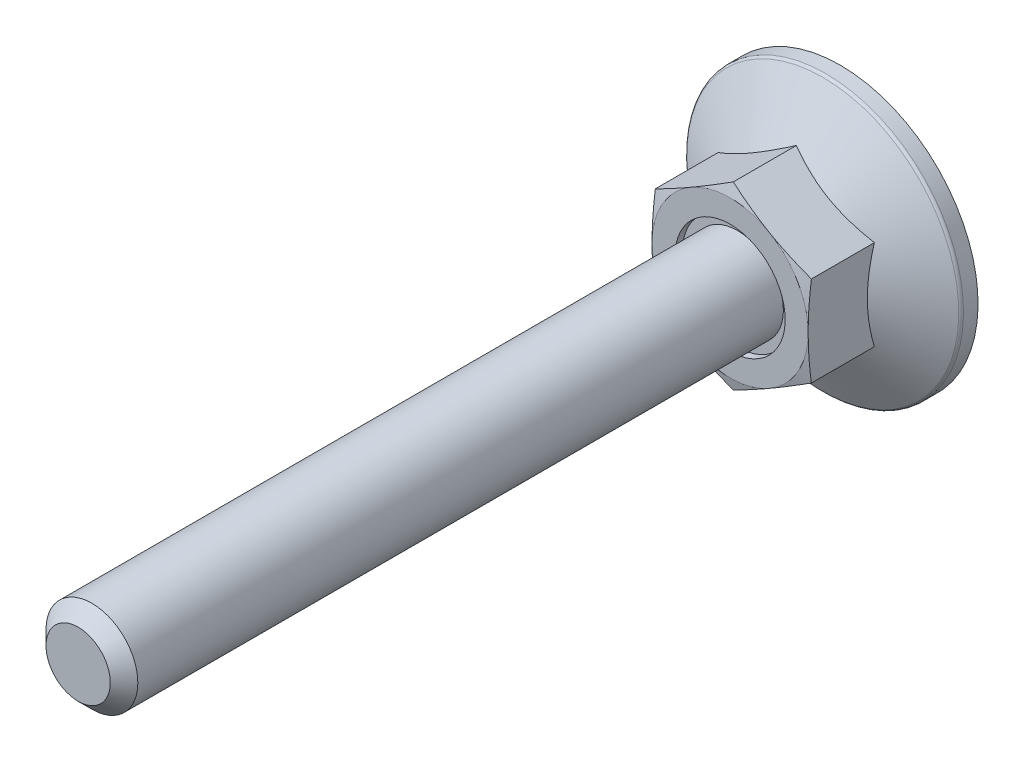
ISO-10303-21;
HEADER;
FILE_DESCRIPTION(('STEP AP214'),'2;1');
FILE_NAME('part.step','',(''),(''),'','','');
FILE_SCHEMA(('AUTOMOTIVE_DESIGN { 1 0 10303 214 1 1 1 1 }'));
ENDSEC;
DATA;
#1=APPLICATION_CONTEXT('core data for automotive mechanical design processes');
#2=APPLICATION_PROTOCOL_DEFINITION('international standard','automotive_design',2000,#1);
#3=PRODUCT_CONTEXT('',#1,'mechanical');
#4=PRODUCT('Part','Part','',(#3));
#5=PRODUCT_RELATED_PRODUCT_CATEGORY('part','',(#4));
#6=PRODUCT_DEFINITION_FORMATION('','',#4);
#7=PRODUCT_DEFINITION_CONTEXT('part definition',#1,'design');
#8=PRODUCT_DEFINITION('design','',#6,#7);
#9=PRODUCT_DEFINITION_SHAPE('','',#8);
#10=(LENGTH_UNIT() NAMED_UNIT(*) SI_UNIT(.MILLI.,.METRE.));
#11=(NAMED_UNIT(*) PLANE_ANGLE_UNIT() SI_UNIT($,.RADIAN.));
#12=(NAMED_UNIT(*) SI_UNIT($,.STERADIAN.) SOLID_ANGLE_UNIT());
#13=UNCERTAINTY_MEASURE_WITH_UNIT(LENGTH_MEASURE(1.E-05),#10,'distance_accuracy_value','');
#14=(GEOMETRIC_REPRESENTATION_CONTEXT(3) GLOBAL_UNCERTAINTY_ASSIGNED_CONTEXT((#13)) GLOBAL_UNIT_ASSIGNED_CONTEXT((#10,
#11,#12)) REPRESENTATION_CONTEXT('',''));
#15=CARTESIAN_POINT('',(0.,0.,0.));
#16=DIRECTION('',(0.,0.,1.));
#17=DIRECTION('',(1.,0.,0.));
#18=AXIS2_PLACEMENT_3D('',#15,#16,#17);
#19=CARTESIAN_POINT('',(0.,0.,11.2));
#20=DIRECTION('',(0.,0.,-1.));
#21=DIRECTION('',(0.,1.,0.));
#22=AXIS2_PLACEMENT_3D('',#19,#20,#21);
#23=PLANE('',#22);
#24=CARTESIAN_POINT('',(0.,0.,11.2));
#25=DIRECTION('',(0.,0.,-1.));
#26=DIRECTION('',(0.,1.,0.));
#27=AXIS2_PLACEMENT_3D('',#24,#25,#26);
#28=CIRCLE('',#27,6.);
#29=CARTESIAN_POINT('',(0.,6.,11.2));
#30=VERTEX_POINT('',#29);
#31=EDGE_CURVE('E108',#30,#30,#28,.T.);
#32=ORIENTED_EDGE('',*,*,#31,.F.);
#33=EDGE_LOOP('',(#32));
#34=FACE_BOUND('',#33,.T.);
#35=CARTESIAN_POINT('',(0.,0.,11.2));
#36=DIRECTION('',(0.,0.,-1.));
#37=DIRECTION('',(0.,1.,0.));
#38=AXIS2_PLACEMENT_3D('',#35,#36,#37);
#39=CIRCLE('',#38,5.);
#40=CARTESIAN_POINT('',(0.,5.,11.2));
#41=VERTEX_POINT('',#40);
#42=EDGE_CURVE('E259',#41,#41,#39,.F.);
#43=ORIENTED_EDGE('',*,*,#42,.F.);
#44=EDGE_LOOP('',(#43));
#45=FACE_BOUND('',#44,.T.);
#46=ADVANCED_FACE('F14',(#34,#45),#23,.F.);
#47=CARTESIAN_POINT('',(0.,9.81495457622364,32.));
#48=DIRECTION('',(0.5,-0.866025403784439,0.));
#49=DIRECTION('',(0.866025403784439,0.5,0.));
#50=AXIS2_PLACEMENT_3D('',#47,#48,#49);
#51=PLANE('',#50);
#52=CARTESIAN_POINT('',(-8.5002,4.90736181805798,4.7935207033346));
#53=CARTESIAN_POINT('',(-8.31336077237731,5.01523349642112,4.85579061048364));
#54=CARTESIAN_POINT('',(-8.1258249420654,5.1235073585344,4.91523445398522));
#55=CARTESIAN_POINT('',(-7.74923024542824,5.34093440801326,5.02769163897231));
#56=CARTESIAN_POINT('',(-7.56017075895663,5.45008795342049,5.08070220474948));
#57=CARTESIAN_POINT('',(-6.9899652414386,5.77929626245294,5.22904336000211));
#58=CARTESIAN_POINT('',(-6.60656835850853,6.00065055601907,5.31341782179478));
#59=CARTESIAN_POINT('',(-6.03282233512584,6.33190297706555,5.41235673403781));
#60=CARTESIAN_POINT('',(-5.84418723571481,6.44081150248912,5.44054155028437));
#61=CARTESIAN_POINT('',(-5.46606397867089,6.65912106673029,5.48780266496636));
#62=CARTESIAN_POINT('',(-5.27657589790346,6.76852206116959,5.5068797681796));
#63=CARTESIAN_POINT('',(-4.8972734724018,6.98751241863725,5.53544197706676));
#64=CARTESIAN_POINT('',(-4.70745974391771,7.09710142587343,5.54493796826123));
#65=CARTESIAN_POINT('',(-4.32765694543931,7.3163806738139,5.55413437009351));
#66=CARTESIAN_POINT('',(-4.13766788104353,7.42607091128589,5.55383508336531));
#67=CARTESIAN_POINT('',(-3.78247698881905,7.63114046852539,5.54412227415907));
#68=CARTESIAN_POINT('',(-3.6172500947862,7.72653426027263,5.53589358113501));
#69=CARTESIAN_POINT('',(-3.28718328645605,7.9170984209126,5.51218750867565));
#70=CARTESIAN_POINT('',(-3.12234339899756,8.01226877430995,5.49670964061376));
#71=CARTESIAN_POINT('',(-2.62846189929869,8.29741139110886,5.43976812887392));
#72=CARTESIAN_POINT('',(-2.30029449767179,8.48687892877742,5.38780368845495));
#73=CARTESIAN_POINT('',(-1.64047857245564,8.86782383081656,5.25789180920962));
#74=CARTESIAN_POINT('',(-1.30891425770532,9.05925257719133,5.17939367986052));
#75=CARTESIAN_POINT('',(-0.650730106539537,9.43925537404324,5.00123540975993));
#76=CARTESIAN_POINT('',(-0.32410184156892,9.62783429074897,4.90161711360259));
#77=CARTESIAN_POINT('',(0.000200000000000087,9.81507004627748,4.7935207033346));
#78=B_SPLINE_CURVE_WITH_KNOTS('',3,(#52,#53,#54,#55,#56,#57,#58,#59,#60,#61,#62,#63,#64,#65,#66,
#67,#68,#69,#70,#71,#72,#73,#74,#75,#76,#77),.UNSPECIFIED.,.F.,.F.,(4,2,2,2,2,2,2,2,2,2,2,2,4),
(0.,0.673596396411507,1.34748239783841,2.69805431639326,3.356799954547,4.01548737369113,
4.67342558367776,5.33134346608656,5.90409556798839,6.47688628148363,7.62328361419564,
8.79510569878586,9.9646274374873),.UNSPECIFIED.);
#79=CARTESIAN_POINT('',(-8.5,4.90747728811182,4.79358737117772));
#80=VERTEX_POINT('',#79);
#81=CARTESIAN_POINT('',(0.,9.81495457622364,4.79358737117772));
#82=VERTEX_POINT('',#81);
#83=EDGE_CURVE('E97',#80,#82,#78,.T.);
#84=ORIENTED_EDGE('',*,*,#83,.F.);
#85=DIRECTION('',(0.,0.,-1.));
#86=VECTOR('',#85,1.);
#87=CARTESIAN_POINT('',(-8.5,4.90747728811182,32.));
#88=LINE('',#87,#86);
#89=CARTESIAN_POINT('',(-8.5,4.90747728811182,11.6476589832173));
#90=VERTEX_POINT('',#89);
#91=EDGE_CURVE('E86',#90,#80,#88,.T.);
#92=ORIENTED_EDGE('',*,*,#91,.F.);
#93=CARTESIAN_POINT('',(0.000200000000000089,9.81507004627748,11.6476280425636));
#94=CARTESIAN_POINT('',(-0.352800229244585,9.61126526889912,11.7022599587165));
#95=CARTESIAN_POINT('',(-0.706440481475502,9.40709097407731,11.7518566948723));
#96=CARTESIAN_POINT('',(-1.41496987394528,8.99802133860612,11.8389934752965));
#97=CARTESIAN_POINT('',(-1.76985946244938,8.79312573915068,11.8765286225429));
#98=CARTESIAN_POINT('',(-2.47873586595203,8.38385575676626,11.9373509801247));
#99=CARTESIAN_POINT('',(-2.83271788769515,8.17948414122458,11.9607107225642));
#100=CARTESIAN_POINT('',(-3.5411333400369,7.77048028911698,11.9920337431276));
#101=CARTESIAN_POINT('',(-3.89556667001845,7.56584811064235,12.));
#102=CARTESIAN_POINT('',(-4.60443332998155,7.15658375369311,12.));
#103=CARTESIAN_POINT('',(-4.9588666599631,6.95195157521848,11.9920337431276));
#104=CARTESIAN_POINT('',(-5.66728211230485,6.54294772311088,11.9607107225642));
#105=CARTESIAN_POINT('',(-6.02126413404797,6.33857610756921,11.9373509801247));
#106=CARTESIAN_POINT('',(-6.73014053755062,5.92930612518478,11.8765286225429));
#107=CARTESIAN_POINT('',(-7.08503012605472,5.72441052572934,11.8389934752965));
#108=CARTESIAN_POINT('',(-7.7935595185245,5.31534089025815,11.7518566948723));
#109=CARTESIAN_POINT('',(-8.14719977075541,5.11116659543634,11.7022599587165));
#110=CARTESIAN_POINT('',(-8.5002,4.90736181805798,11.6476280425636));
#111=B_SPLINE_CURVE_WITH_KNOTS('',3,(#93,#94,#95,#96,#97,#98,#99,#100,#101,#102,#103,#104,#105,
#106,#107,#108,#109,#110),.UNSPECIFIED.,.F.,.F.,(4,2,2,2,2,2,2,2,4),(0.,1.23382789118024,
2.46815608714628,3.69611406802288,4.92383440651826,6.15155474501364,7.37951272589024,
8.61384092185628,9.84766881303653),.UNSPECIFIED.);
#112=CARTESIAN_POINT('',(-4.25,7.36121593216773,12.));
#113=VERTEX_POINT('',#112);
#114=EDGE_CURVE('E186',#113,#90,#111,.T.);
#115=ORIENTED_EDGE('',*,*,#114,.F.);
#116=CARTESIAN_POINT('',(0.,9.81495457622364,11.6476589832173));
#117=VERTEX_POINT('',#116);
#118=EDGE_CURVE('E318',#117,#113,#111,.T.);
#119=ORIENTED_EDGE('',*,*,#118,.F.);
#120=DIRECTION('',(0.,0.,-1.));
#121=VECTOR('',#120,1.);
#122=CARTESIAN_POINT('',(0.,9.81495457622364,32.));
#123=LINE('',#122,#121);
#124=EDGE_CURVE('E101',#117,#82,#123,.T.);
#125=ORIENTED_EDGE('',*,*,#124,.T.);
#126=EDGE_LOOP('',(#84,#92,#115,#119,#125));
#127=FACE_BOUND('',#126,.T.);
#128=ADVANCED_FACE('F100',(#127),#51,.F.);
#129=CARTESIAN_POINT('',(8.5,4.90747728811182,32.));
#130=DIRECTION('',(-0.5,-0.866025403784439,0.));
#131=DIRECTION('',(0.866025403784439,-0.5,0.));
#132=AXIS2_PLACEMENT_3D('',#129,#130,#131);
#133=PLANE('',#132);
#134=CARTESIAN_POINT('',(-0.0002,9.81507004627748,4.7935207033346));
#135=CARTESIAN_POINT('',(0.186639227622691,9.70719836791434,4.85579061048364));
#136=CARTESIAN_POINT('',(0.374175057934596,9.59892450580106,4.91523445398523));
#137=CARTESIAN_POINT('',(0.750769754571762,9.3814974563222,5.02769163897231));
#138=CARTESIAN_POINT('',(0.939829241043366,9.27234391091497,5.08070220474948));
#139=CARTESIAN_POINT('',(1.5100347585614,8.94313560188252,5.22904336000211));
#140=CARTESIAN_POINT('',(1.89343164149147,8.72178130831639,5.31341782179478));
#141=CARTESIAN_POINT('',(2.46717766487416,8.39052888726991,5.41235673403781));
#142=CARTESIAN_POINT('',(2.65581276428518,8.28162036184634,5.44054155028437));
#143=CARTESIAN_POINT('',(3.03393602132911,8.06331079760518,5.48780266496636));
#144=CARTESIAN_POINT('',(3.22342410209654,7.95390980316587,5.5068797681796));
#145=CARTESIAN_POINT('',(3.6027265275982,7.73491944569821,5.53544197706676));
#146=CARTESIAN_POINT('',(3.79254025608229,7.62533043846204,5.54493796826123));
#147=CARTESIAN_POINT('',(4.17234305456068,7.40605119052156,5.55413437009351));
#148=CARTESIAN_POINT('',(4.36233211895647,7.29636095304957,5.55383508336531));
#149=CARTESIAN_POINT('',(4.71752301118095,7.09129139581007,5.54412227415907));
#150=CARTESIAN_POINT('',(4.8827499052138,6.99589760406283,5.53589358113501));
#151=CARTESIAN_POINT('',(5.21281671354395,6.80533344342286,5.51218750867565));
#152=CARTESIAN_POINT('',(5.37765660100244,6.71016309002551,5.49670964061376));
#153=CARTESIAN_POINT('',(5.87153810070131,6.42502047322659,5.43976812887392));
#154=CARTESIAN_POINT('',(6.19970550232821,6.23555293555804,5.38780368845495));
#155=CARTESIAN_POINT('',(6.85952142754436,5.8546080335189,5.25789180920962));
#156=CARTESIAN_POINT('',(7.19108574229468,5.66317928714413,5.17939367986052));
#157=CARTESIAN_POINT('',(7.84926989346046,5.28317649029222,5.00123540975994));
#158=CARTESIAN_POINT('',(8.17589815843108,5.09459757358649,4.90161711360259));
#159=CARTESIAN_POINT('',(8.5002,4.90736181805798,4.7935207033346));
#160=B_SPLINE_CURVE_WITH_KNOTS('',3,(#134,#135,#136,#137,#138,#139,#140,#141,#142,#143,#144,
#145,#146,#147,#148,#149,#150,#151,#152,#153,#154,#155,#156,#157,#158,#159),.UNSPECIFIED.,.F.,
.F.,(4,2,2,2,2,2,2,2,2,2,2,2,4),(0.,0.673596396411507,1.34748239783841,2.69805431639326,
3.356799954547,4.01548737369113,4.67342558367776,5.33134346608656,5.90409556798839,
6.47688628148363,7.62328361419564,8.79510569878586,9.9646274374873),.UNSPECIFIED.);
#161=CARTESIAN_POINT('',(8.5,4.90747728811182,4.79358737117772));
#162=VERTEX_POINT('',#161);
#163=EDGE_CURVE('E29',#82,#162,#160,.T.);
#164=ORIENTED_EDGE('',*,*,#163,.F.);
#165=ORIENTED_EDGE('',*,*,#124,.F.);
#166=CARTESIAN_POINT('',(8.5002,4.90736181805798,11.6476280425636));
#167=CARTESIAN_POINT('',(8.14719977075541,5.11116659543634,11.7022599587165));
#168=CARTESIAN_POINT('',(7.7935595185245,5.31534089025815,11.7518566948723));
#169=CARTESIAN_POINT('',(7.08503012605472,5.72441052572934,11.8389934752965));
#170=CARTESIAN_POINT('',(6.73014053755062,5.92930612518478,11.8765286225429));
#171=CARTESIAN_POINT('',(6.02126413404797,6.33857610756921,11.9373509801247));
#172=CARTESIAN_POINT('',(5.66728211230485,6.54294772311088,11.9607107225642));
#173=CARTESIAN_POINT('',(4.9588666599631,6.95195157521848,11.9920337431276));
#174=CARTESIAN_POINT('',(4.60443332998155,7.15658375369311,12.));
#175=CARTESIAN_POINT('',(3.89556667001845,7.56584811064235,12.));
#176=CARTESIAN_POINT('',(3.5411333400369,7.77048028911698,11.9920337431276));
#177=CARTESIAN_POINT('',(2.83271788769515,8.17948414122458,11.9607107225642));
#178=CARTESIAN_POINT('',(2.47873586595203,8.38385575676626,11.9373509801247));
#179=CARTESIAN_POINT('',(1.76985946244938,8.79312573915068,11.8765286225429));
#180=CARTESIAN_POINT('',(1.41496987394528,8.99802133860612,11.8389934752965));
#181=CARTESIAN_POINT('',(0.706440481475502,9.40709097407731,11.7518566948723));
#182=CARTESIAN_POINT('',(0.352800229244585,9.61126526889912,11.7022599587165));
#183=CARTESIAN_POINT('',(-0.000200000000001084,9.81507004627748,11.6476280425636));
#184=B_SPLINE_CURVE_WITH_KNOTS('',3,(#166,#167,#168,#169,#170,#171,#172,#173,#174,#175,#176,
#177,#178,#179,#180,#181,#182,#183),.UNSPECIFIED.,.F.,.F.,(4,2,2,2,2,2,2,2,4),(0.,
1.23382789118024,2.46815608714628,3.69611406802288,4.92383440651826,6.15155474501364,
7.37951272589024,8.61384092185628,9.84766881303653),.UNSPECIFIED.);
#185=CARTESIAN_POINT('',(4.25,7.36121593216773,12.));
#186=VERTEX_POINT('',#185);
#187=EDGE_CURVE('E177',#186,#117,#184,.T.);
#188=ORIENTED_EDGE('',*,*,#187,.F.);
#189=CARTESIAN_POINT('',(8.5,4.90747728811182,11.6476589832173));
#190=VERTEX_POINT('',#189);
#191=EDGE_CURVE('E184',#190,#186,#184,.T.);
#192=ORIENTED_EDGE('',*,*,#191,.F.);
#193=DIRECTION('',(0.,0.,-1.));
#194=VECTOR('',#193,1.);
#195=CARTESIAN_POINT('',(8.5,4.90747728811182,32.));
#196=LINE('',#195,#194);
#197=EDGE_CURVE('E216',#190,#162,#196,.T.);
#198=ORIENTED_EDGE('',*,*,#197,.T.);
#199=EDGE_LOOP('',(#164,#165,#188,#192,#198));
#200=FACE_BOUND('',#199,.T.);
#201=ADVANCED_FACE('F192',(#200),#133,.F.);
#202=CARTESIAN_POINT('',(8.5,-4.90747728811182,32.));
#203=DIRECTION('',(-1.,0.,0.));
#204=DIRECTION('',(0.,-1.,0.));
#205=AXIS2_PLACEMENT_3D('',#202,#203,#204);
#206=PLANE('',#205);
#207=CARTESIAN_POINT('',(8.5,13.0314294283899,1.47752704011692));
#208=CARTESIAN_POINT('',(8.5,12.6612665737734,1.65647774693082));
#209=CARTESIAN_POINT('',(8.5,12.290237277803,1.83366776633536));
#210=CARTESIAN_POINT('',(8.5,11.5459841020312,2.1835324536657));
#211=CARTESIAN_POINT('',(8.5,11.1727598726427,2.3562063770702));
#212=CARTESIAN_POINT('',(8.5,10.4216603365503,2.69694543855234));
#213=CARTESIAN_POINT('',(8.5,10.0437706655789,2.86497902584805));
#214=CARTESIAN_POINT('',(8.5,9.2849306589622,3.19396010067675));
#215=CARTESIAN_POINT('',(8.5,8.90398047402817,3.35490793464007));
#216=CARTESIAN_POINT('',(8.5,8.12702308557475,3.67249615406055));
#217=CARTESIAN_POINT('',(8.5,7.73090483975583,3.82886642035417));
#218=CARTESIAN_POINT('',(8.5,6.93398073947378,4.12940330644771));
#219=CARTESIAN_POINT('',(8.5,6.53317435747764,4.27356853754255));
#220=CARTESIAN_POINT('',(8.5,5.72703031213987,4.54580160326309));
#221=CARTESIAN_POINT('',(8.5,5.32170421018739,4.67390329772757));
#222=CARTESIAN_POINT('',(8.5,4.50525785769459,4.90980359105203));
#223=CARTESIAN_POINT('',(8.5,4.09413952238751,5.01760873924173));
#224=CARTESIAN_POINT('',(8.5,3.26789885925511,5.20711197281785));
#225=CARTESIAN_POINT('',(8.5,2.85280627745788,5.28893618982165));
#226=CARTESIAN_POINT('',(8.5,2.22651264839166,5.38853539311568));
#227=CARTESIAN_POINT('',(8.5,2.01712321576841,5.41788026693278));
#228=CARTESIAN_POINT('',(8.5,1.59735566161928,5.46827917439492));
#229=CARTESIAN_POINT('',(8.5,1.38697763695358,5.48933400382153));
#230=CARTESIAN_POINT('',(8.5,0.968196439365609,5.52247691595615));
#231=CARTESIAN_POINT('',(8.5,0.759802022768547,5.53467524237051));
#232=CARTESIAN_POINT('',(8.5,0.342684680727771,5.55026003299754));
#233=CARTESIAN_POINT('',(8.5,0.133961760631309,5.5536466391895));
#234=CARTESIAN_POINT('',(8.5,-0.283445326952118,5.55152742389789));
#235=CARTESIAN_POINT('',(8.5,-0.492129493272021,5.546021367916));
#236=CARTESIAN_POINT('',(8.5,-0.909085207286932,5.52624824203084));
#237=CARTESIAN_POINT('',(8.5,-1.11735673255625,5.51198070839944));
#238=CARTESIAN_POINT('',(8.5,-1.62231800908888,5.46706351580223));
#239=CARTESIAN_POINT('',(8.5,-1.91862399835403,5.43201243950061));
#240=CARTESIAN_POINT('',(8.5,-2.50892471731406,5.34612267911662));
#241=CARTESIAN_POINT('',(8.5,-2.80291910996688,5.29528173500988));
#242=CARTESIAN_POINT('',(8.5,-3.68114216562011,5.12178025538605));
#243=CARTESIAN_POINT('',(8.5,-4.26128126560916,4.97817413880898));
#244=CARTESIAN_POINT('',(8.5,-5.12903133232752,4.73045572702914));
#245=CARTESIAN_POINT('',(8.5,-5.42116721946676,4.64129591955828));
#246=CARTESIAN_POINT('',(8.5,-6.0025970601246,4.45406394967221));
#247=CARTESIAN_POINT('',(8.5,-6.29189099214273,4.35599171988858));
#248=CARTESIAN_POINT('',(8.5,-6.86774141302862,4.15248019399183));
#249=CARTESIAN_POINT('',(8.5,-7.15429879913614,4.0470434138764));
#250=CARTESIAN_POINT('',(8.5,-7.72505625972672,3.83000899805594));
#251=CARTESIAN_POINT('',(8.5,-8.00925638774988,3.71841150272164));
#252=CARTESIAN_POINT('',(8.5,-8.7865968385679,3.40502511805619));
#253=CARTESIAN_POINT('',(8.5,-9.2776226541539,3.197996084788));
#254=CARTESIAN_POINT('',(8.5,-10.2546964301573,2.77246752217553));
#255=CARTESIAN_POINT('',(8.5,-10.7407438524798,2.55396676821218));
#256=CARTESIAN_POINT('',(8.5,-11.7090438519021,2.108282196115));
#257=CARTESIAN_POINT('',(8.5,-12.1912949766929,1.88109523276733));
#258=CARTESIAN_POINT('',(8.5,-13.1526185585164,1.42016244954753));
#259=CARTESIAN_POINT('',(8.5,-13.6316911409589,1.18641689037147));
#260=CARTESIAN_POINT('',(8.5,-14.588034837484,0.713462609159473));
#261=CARTESIAN_POINT('',(8.5,-15.0653020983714,0.47424611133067));
#262=CARTESIAN_POINT('',(8.5,-16.0177905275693,-0.00822936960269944));
#263=CARTESIAN_POINT('',(8.5,-16.4930116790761,-0.251488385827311));
#264=CARTESIAN_POINT('',(8.5,-17.4416812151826,-0.741191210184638));
#265=CARTESIAN_POINT('',(8.5,-17.9151299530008,-0.987634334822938));
#266=CARTESIAN_POINT('',(8.5,-18.8606492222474,-1.48315179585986));
#267=CARTESIAN_POINT('',(8.5,-19.3327197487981,-1.73222614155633));
#268=CARTESIAN_POINT('',(8.5,-20.6461392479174,-2.42904815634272));
#269=CARTESIAN_POINT('',(8.5,-21.4862394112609,-2.87914918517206));
#270=CARTESIAN_POINT('',(8.5,-23.1638169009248,-3.78432075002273));
#271=CARTESIAN_POINT('',(8.5,-24.0012940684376,-4.23939157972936));
#272=CARTESIAN_POINT('',(8.5,-25.671623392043,-5.15180725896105));
#273=CARTESIAN_POINT('',(8.5,-26.5044818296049,-5.60914061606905));
#274=CARTESIAN_POINT('',(8.5,-27.7525740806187,-6.29723391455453));
#275=CARTESIAN_POINT('',(8.5,-28.1683903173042,-6.52693873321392));
#276=CARTESIAN_POINT('',(8.5,-28.9996764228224,-6.98697325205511));
#277=CARTESIAN_POINT('',(8.5,-29.4151462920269,-7.21730295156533));
#278=CARTESIAN_POINT('',(8.5,-29.8304643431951,-7.44790614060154));
#279=B_SPLINE_CURVE_WITH_KNOTS('',3,(#207,#208,#209,#210,#211,#212,#213,#214,#215,#216,#217,
#218,#219,#220,#221,#222,#223,#224,#225,#226,#227,#228,#229,#230,#231,#232,#233,#234,#235,#236,
#237,#238,#239,#240,#241,#242,#243,#244,#245,#246,#247,#248,#249,#250,#251,#252,#253,#254,#255,
#256,#257,#258,#259,#260,#261,#262,#263,#264,#265,#266,#267,#268,#269,#270,#271,#272,#273,#274,
#275,#276,#277,#278),.UNSPECIFIED.,.F.,.F.,(4,2,2,2,2,2,2,2,2,2,2,2,2,2,2,2,2,2,2,2,2,2,2,2,2,2,
2,2,2,2,2,2,2,2,2,4),(0.,1.23346428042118,2.46713064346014,3.70776702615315,4.94834268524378,
6.22578289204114,7.5033682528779,8.77821366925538,10.0526470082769,11.32079515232,
11.9549638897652,12.5890717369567,13.2151443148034,13.8412068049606,14.4672858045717,
15.0933979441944,15.9880059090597,16.8827419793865,18.6732029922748,19.5894472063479,
20.5056983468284,21.4216379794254,22.3375567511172,23.9359919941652,25.5345982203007,
27.1337888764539,28.7329160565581,30.3344778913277,31.9360528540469,33.5372895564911,
35.1385319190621,37.9977422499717,40.8571224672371,43.7075995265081,45.1327331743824,
46.5578652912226),.UNSPECIFIED.);
#280=CARTESIAN_POINT('',(8.5,-4.90747728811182,4.79358737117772));
#281=VERTEX_POINT('',#280);
#282=EDGE_CURVE('E37',#162,#281,#279,.T.);
#283=ORIENTED_EDGE('',*,*,#282,.F.);
#284=ORIENTED_EDGE('',*,*,#197,.F.);
#285=CARTESIAN_POINT('',(8.5,12.9820891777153,10.1197370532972));
#286=CARTESIAN_POINT('',(8.5,12.5964686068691,10.2061594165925));
#287=CARTESIAN_POINT('',(8.5,12.2106068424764,10.2915248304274));
#288=CARTESIAN_POINT('',(8.5,11.4382824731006,10.4595712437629));
#289=CARTESIAN_POINT('',(8.5,11.0518198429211,10.5422521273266));
#290=CARTESIAN_POINT('',(8.5,10.2778290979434,10.7044309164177));
#291=CARTESIAN_POINT('',(8.5,9.89030030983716,10.7839256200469));
#292=CARTESIAN_POINT('',(8.5,9.11443612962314,10.9388739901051));
#293=CARTESIAN_POINT('',(8.5,8.72610074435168,11.0143276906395));
#294=CARTESIAN_POINT('',(8.5,7.95158013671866,11.159650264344));
#295=CARTESIAN_POINT('',(8.5,7.56540239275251,11.2295587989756));
#296=CARTESIAN_POINT('',(8.5,6.79199352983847,11.3632725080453));
#297=CARTESIAN_POINT('',(8.5,6.40476243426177,11.4270778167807));
#298=CARTESIAN_POINT('',(8.5,5.62917169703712,11.54714843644));
#299=CARTESIAN_POINT('',(8.5,5.24081220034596,11.6034146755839));
#300=CARTESIAN_POINT('',(8.5,4.46285737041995,11.70674908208));
#301=CARTESIAN_POINT('',(8.5,4.07326203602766,11.7538172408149));
#302=CARTESIAN_POINT('',(8.5,3.28844017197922,11.8374226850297));
#303=CARTESIAN_POINT('',(8.5,2.89320002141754,11.8738340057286));
#304=CARTESIAN_POINT('',(8.5,2.10172608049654,11.9336139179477));
#305=CARTESIAN_POINT('',(8.5,1.70549231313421,11.9569828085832));
#306=CARTESIAN_POINT('',(8.5,0.91260591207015,11.9893148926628));
#307=CARTESIAN_POINT('',(8.5,0.515953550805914,11.9982846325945));
#308=CARTESIAN_POINT('',(8.5,-0.277408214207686,12.0012669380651));
#309=CARTESIAN_POINT('',(8.5,-0.674117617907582,11.9952795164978));
#310=CARTESIAN_POINT('',(8.5,-1.46847963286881,11.9686842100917));
#311=CARTESIAN_POINT('',(8.5,-1.86613043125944,11.9480232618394));
#312=CARTESIAN_POINT('',(8.5,-2.66049684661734,11.8932602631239));
#313=CARTESIAN_POINT('',(8.5,-3.05721244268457,11.8591579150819));
#314=CARTESIAN_POINT('',(8.5,-3.84970511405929,11.7792347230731));
#315=CARTESIAN_POINT('',(8.5,-4.24548140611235,11.7334062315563));
#316=CARTESIAN_POINT('',(8.5,-5.03576028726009,11.6319377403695));
#317=CARTESIAN_POINT('',(8.5,-5.43026287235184,11.5762977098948));
#318=CARTESIAN_POINT('',(8.5,-6.19195385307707,11.4609360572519));
#319=CARTESIAN_POINT('',(8.5,-6.55922094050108,11.4017287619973));
#320=CARTESIAN_POINT('',(8.5,-7.29278719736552,11.2775674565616));
#321=CARTESIAN_POINT('',(8.5,-7.65908634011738,11.2126132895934));
#322=CARTESIAN_POINT('',(8.5,-8.39085027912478,11.078008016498));
#323=CARTESIAN_POINT('',(8.5,-8.75631499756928,11.0083564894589));
#324=CARTESIAN_POINT('',(8.5,-9.48649515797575,10.8652200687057));
#325=CARTESIAN_POINT('',(8.5,-9.85121059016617,10.7917351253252));
#326=CARTESIAN_POINT('',(8.5,-10.5800753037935,10.6416087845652));
#327=CARTESIAN_POINT('',(8.5,-10.944224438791,10.5649666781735));
#328=CARTESIAN_POINT('',(8.5,-11.6719684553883,10.4090909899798));
#329=CARTESIAN_POINT('',(8.5,-12.0355633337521,10.3298573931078));
#330=CARTESIAN_POINT('',(8.5,-13.1255915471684,10.0889686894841));
#331=CARTESIAN_POINT('',(8.5,-13.8513178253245,9.92411536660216));
#332=CARTESIAN_POINT('',(8.5,-15.2942598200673,9.59010912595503));
#333=CARTESIAN_POINT('',(8.5,-16.0114890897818,9.42101437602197));
#334=CARTESIAN_POINT('',(8.5,-17.4449475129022,9.07858755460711));
#335=CARTESIAN_POINT('',(8.5,-18.1611766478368,8.90525540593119));
#336=CARTESIAN_POINT('',(8.5,-19.5919856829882,8.5556799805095));
#337=CARTESIAN_POINT('',(8.5,-20.306566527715,8.37944056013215));
#338=CARTESIAN_POINT('',(8.5,-21.7351057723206,8.02455520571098));
#339=CARTESIAN_POINT('',(8.5,-22.4490641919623,7.8459093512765));
#340=CARTESIAN_POINT('',(8.5,-23.1628057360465,7.66641079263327));
#341=B_SPLINE_CURVE_WITH_KNOTS('',3,(#285,#286,#287,#288,#289,#290,#291,#292,#293,#294,#295,
#296,#297,#298,#299,#300,#301,#302,#303,#304,#305,#306,#307,#308,#309,#310,#311,#312,#313,#314,
#315,#316,#317,#318,#319,#320,#321,#322,#323,#324,#325,#326,#327,#328,#329,#330,#331,#332,#333,
#334,#335,#336,#337,#338,#339,#340),.UNSPECIFIED.,.F.,.F.,(4,2,2,2,2,2,2,2,2,2,2,2,2,2,2,2,2,2,
2,2,2,2,2,2,2,2,2,4),(0.,1.18556310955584,2.37117735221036,3.55795462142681,4.74472187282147,
5.92204594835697,7.09934411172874,8.27649719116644,9.45365137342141,10.6442044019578,
11.8347301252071,13.0247144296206,14.2146977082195,15.4090063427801,16.6033414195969,
17.7984574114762,18.9935771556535,20.1095500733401,21.2255534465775,22.3416569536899,
23.4577749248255,24.5741449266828,25.6905214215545,27.9231231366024,30.1337863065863,
32.3444897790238,34.5524651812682,36.7603677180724),.UNSPECIFIED.);
#342=CARTESIAN_POINT('',(8.5,0.,12.));
#343=VERTEX_POINT('',#342);
#344=EDGE_CURVE('E170',#343,#190,#341,.F.);
#345=ORIENTED_EDGE('',*,*,#344,.F.);
#346=CARTESIAN_POINT('',(8.5,-4.90747728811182,11.6476589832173));
#347=VERTEX_POINT('',#346);
#348=EDGE_CURVE('E185',#347,#343,#341,.F.);
#349=ORIENTED_EDGE('',*,*,#348,.F.);
#350=DIRECTION('',(0.,0.,-1.));
#351=VECTOR('',#350,1.);
#352=CARTESIAN_POINT('',(8.5,-4.90747728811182,32.));
#353=LINE('',#352,#351);
#354=EDGE_CURVE('E218',#347,#281,#353,.T.);
#355=ORIENTED_EDGE('',*,*,#354,.T.);
#356=EDGE_LOOP('',(#283,#284,#345,#349,#355));
#357=FACE_BOUND('',#356,.T.);
#358=ADVANCED_FACE('F195',(#357),#206,.F.);
#359=CARTESIAN_POINT('',(0.,-9.81495457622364,32.));
#360=DIRECTION('',(-0.5,0.866025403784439,0.));
#361=DIRECTION('',(-0.866025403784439,-0.5,0.));
#362=AXIS2_PLACEMENT_3D('',#359,#360,#361);
#363=PLANE('',#362);
#364=CARTESIAN_POINT('',(8.5002,-4.90736181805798,4.7935207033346));
#365=CARTESIAN_POINT('',(8.31336077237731,-5.01523349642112,4.85579061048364));
#366=CARTESIAN_POINT('',(8.1258249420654,-5.1235073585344,4.91523445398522));
#367=CARTESIAN_POINT('',(7.74923024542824,-5.34093440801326,5.02769163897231));
#368=CARTESIAN_POINT('',(7.56017075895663,-5.45008795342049,5.08070220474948));
#369=CARTESIAN_POINT('',(6.9899652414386,-5.77929626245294,5.22904336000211));
#370=CARTESIAN_POINT('',(6.60656835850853,-6.00065055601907,5.31341782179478));
#371=CARTESIAN_POINT('',(6.03282233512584,-6.33190297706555,5.41235673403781));
#372=CARTESIAN_POINT('',(5.84418723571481,-6.44081150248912,5.44054155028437));
#373=CARTESIAN_POINT('',(5.46606397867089,-6.65912106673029,5.48780266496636));
#374=CARTESIAN_POINT('',(5.27657589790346,-6.76852206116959,5.5068797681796));
#375=CARTESIAN_POINT('',(4.8972734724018,-6.98751241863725,5.53544197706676));
#376=CARTESIAN_POINT('',(4.70745974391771,-7.09710142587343,5.54493796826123));
#377=CARTESIAN_POINT('',(4.32765694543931,-7.3163806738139,5.55413437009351));
#378=CARTESIAN_POINT('',(4.13766788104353,-7.42607091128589,5.55383508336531));
#379=CARTESIAN_POINT('',(3.78247698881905,-7.63114046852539,5.54412227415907));
#380=CARTESIAN_POINT('',(3.6172500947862,-7.72653426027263,5.53589358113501));
#381=CARTESIAN_POINT('',(3.28718328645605,-7.9170984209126,5.51218750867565));
#382=CARTESIAN_POINT('',(3.12234339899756,-8.01226877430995,5.49670964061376));
#383=CARTESIAN_POINT('',(2.62846189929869,-8.29741139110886,5.43976812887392));
#384=CARTESIAN_POINT('',(2.30029449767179,-8.48687892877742,5.38780368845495));
#385=CARTESIAN_POINT('',(1.64047857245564,-8.86782383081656,5.25789180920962));
#386=CARTESIAN_POINT('',(1.30891425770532,-9.05925257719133,5.17939367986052));
#387=CARTESIAN_POINT('',(0.650730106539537,-9.43925537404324,5.00123540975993));
#388=CARTESIAN_POINT('',(0.32410184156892,-9.62783429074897,4.90161711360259));
#389=CARTESIAN_POINT('',(-0.000200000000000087,-9.81507004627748,4.7935207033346));
#390=B_SPLINE_CURVE_WITH_KNOTS('',3,(#364,#365,#366,#367,#368,#369,#370,#371,#372,#373,#374,
#375,#376,#377,#378,#379,#380,#381,#382,#383,#384,#385,#386,#387,#388,#389),.UNSPECIFIED.,.F.,
.F.,(4,2,2,2,2,2,2,2,2,2,2,2,4),(0.,0.673596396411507,1.34748239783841,2.69805431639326,
3.356799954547,4.01548737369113,4.67342558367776,5.33134346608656,5.90409556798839,
6.47688628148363,7.62328361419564,8.79510569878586,9.9646274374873),.UNSPECIFIED.);
#391=CARTESIAN_POINT('',(0.,-9.81495457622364,4.79358737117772));
#392=VERTEX_POINT('',#391);
#393=EDGE_CURVE('E276',#281,#392,#390,.T.);
#394=ORIENTED_EDGE('',*,*,#393,.F.);
#395=ORIENTED_EDGE('',*,*,#354,.F.);
#396=CARTESIAN_POINT('',(-0.000200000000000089,-9.81507004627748,11.6476280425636));
#397=CARTESIAN_POINT('',(0.352800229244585,-9.61126526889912,11.7022599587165));
#398=CARTESIAN_POINT('',(0.706440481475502,-9.40709097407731,11.7518566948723));
#399=CARTESIAN_POINT('',(1.41496987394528,-8.99802133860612,11.8389934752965));
#400=CARTESIAN_POINT('',(1.76985946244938,-8.79312573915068,11.8765286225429));
#401=CARTESIAN_POINT('',(2.47873586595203,-8.38385575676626,11.9373509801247));
#402=CARTESIAN_POINT('',(2.83271788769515,-8.17948414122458,11.9607107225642));
#403=CARTESIAN_POINT('',(3.5411333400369,-7.77048028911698,11.9920337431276));
#404=CARTESIAN_POINT('',(3.89556667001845,-7.56584811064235,12.));
#405=CARTESIAN_POINT('',(4.60443332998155,-7.15658375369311,12.));
#406=CARTESIAN_POINT('',(4.9588666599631,-6.95195157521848,11.9920337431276));
#407=CARTESIAN_POINT('',(5.66728211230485,-6.54294772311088,11.9607107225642));
#408=CARTESIAN_POINT('',(6.02126413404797,-6.33857610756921,11.9373509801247));
#409=CARTESIAN_POINT('',(6.73014053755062,-5.92930612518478,11.8765286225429));
#410=CARTESIAN_POINT('',(7.08503012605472,-5.72441052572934,11.8389934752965));
#411=CARTESIAN_POINT('',(7.7935595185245,-5.31534089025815,11.7518566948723));
#412=CARTESIAN_POINT('',(8.14719977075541,-5.11116659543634,11.7022599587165));
#413=CARTESIAN_POINT('',(8.5002,-4.90736181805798,11.6476280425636));
#414=B_SPLINE_CURVE_WITH_KNOTS('',3,(#396,#397,#398,#399,#400,#401,#402,#403,#404,#405,#406,
#407,#408,#409,#410,#411,#412,#413),.UNSPECIFIED.,.F.,.F.,(4,2,2,2,2,2,2,2,4),(0.,
1.23382789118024,2.46815608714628,3.69611406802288,4.92383440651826,6.15155474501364,
7.37951272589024,8.61384092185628,9.84766881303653),.UNSPECIFIED.);
#415=CARTESIAN_POINT('',(4.25,-7.36121593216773,12.));
#416=VERTEX_POINT('',#415);
#417=EDGE_CURVE('E164',#416,#347,#414,.T.);
#418=ORIENTED_EDGE('',*,*,#417,.F.);
#419=CARTESIAN_POINT('',(0.,-9.81495457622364,11.6476589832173));
#420=VERTEX_POINT('',#419);
#421=EDGE_CURVE('E299',#420,#416,#414,.T.);
#422=ORIENTED_EDGE('',*,*,#421,.F.);
#423=DIRECTION('',(0.,0.,-1.));
#424=VECTOR('',#423,1.);
#425=CARTESIAN_POINT('',(0.,-9.81495457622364,32.));
#426=LINE('',#425,#424);
#427=EDGE_CURVE('E220',#420,#392,#426,.T.);
#428=ORIENTED_EDGE('',*,*,#427,.T.);
#429=EDGE_LOOP('',(#394,#395,#418,#422,#428));
#430=FACE_BOUND('',#429,.T.);
#431=ADVANCED_FACE('F281',(#430),#363,.F.);
#432=CARTESIAN_POINT('',(-8.5,-4.90747728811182,32.));
#433=DIRECTION('',(0.5,0.866025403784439,0.));
#434=DIRECTION('',(-0.866025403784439,0.5,0.));
#435=AXIS2_PLACEMENT_3D('',#432,#433,#434);
#436=PLANE('',#435);
#437=CARTESIAN_POINT('',(0.0002,-9.81507004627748,4.7935207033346));
#438=CARTESIAN_POINT('',(-0.186639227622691,-9.70719836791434,4.85579061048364));
#439=CARTESIAN_POINT('',(-0.374175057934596,-9.59892450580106,4.91523445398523));
#440=CARTESIAN_POINT('',(-0.750769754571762,-9.3814974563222,5.02769163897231));
#441=CARTESIAN_POINT('',(-0.939829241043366,-9.27234391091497,5.08070220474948));
#442=CARTESIAN_POINT('',(-1.5100347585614,-8.94313560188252,5.22904336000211));
#443=CARTESIAN_POINT('',(-1.89343164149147,-8.72178130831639,5.31341782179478));
#444=CARTESIAN_POINT('',(-2.46717766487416,-8.39052888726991,5.41235673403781));
#445=CARTESIAN_POINT('',(-2.65581276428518,-8.28162036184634,5.44054155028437));
#446=CARTESIAN_POINT('',(-3.03393602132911,-8.06331079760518,5.48780266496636));
#447=CARTESIAN_POINT('',(-3.22342410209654,-7.95390980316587,5.5068797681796));
#448=CARTESIAN_POINT('',(-3.6027265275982,-7.73491944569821,5.53544197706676));
#449=CARTESIAN_POINT('',(-3.79254025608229,-7.62533043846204,5.54493796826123));
#450=CARTESIAN_POINT('',(-4.17234305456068,-7.40605119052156,5.55413437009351));
#451=CARTESIAN_POINT('',(-4.36233211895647,-7.29636095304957,5.55383508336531));
#452=CARTESIAN_POINT('',(-4.71752301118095,-7.09129139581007,5.54412227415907));
#453=CARTESIAN_POINT('',(-4.8827499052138,-6.99589760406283,5.53589358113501));
#454=CARTESIAN_POINT('',(-5.21281671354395,-6.80533344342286,5.51218750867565));
#455=CARTESIAN_POINT('',(-5.37765660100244,-6.71016309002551,5.49670964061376));
#456=CARTESIAN_POINT('',(-5.87153810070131,-6.42502047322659,5.43976812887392));
#457=CARTESIAN_POINT('',(-6.19970550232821,-6.23555293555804,5.38780368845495));
#458=CARTESIAN_POINT('',(-6.85952142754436,-5.8546080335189,5.25789180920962));
#459=CARTESIAN_POINT('',(-7.19108574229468,-5.66317928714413,5.17939367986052));
#460=CARTESIAN_POINT('',(-7.84926989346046,-5.28317649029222,5.00123540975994));
#461=CARTESIAN_POINT('',(-8.17589815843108,-5.09459757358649,4.90161711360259));
#462=CARTESIAN_POINT('',(-8.5002,-4.90736181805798,4.7935207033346));
#463=B_SPLINE_CURVE_WITH_KNOTS('',3,(#437,#438,#439,#440,#441,#442,#443,#444,#445,#446,#447,
#448,#449,#450,#451,#452,#453,#454,#455,#456,#457,#458,#459,#460,#461,#462),.UNSPECIFIED.,.F.,
.F.,(4,2,2,2,2,2,2,2,2,2,2,2,4),(0.,0.673596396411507,1.34748239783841,2.69805431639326,
3.356799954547,4.01548737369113,4.67342558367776,5.33134346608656,5.90409556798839,
6.47688628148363,7.62328361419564,8.79510569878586,9.9646274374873),.UNSPECIFIED.);
#464=CARTESIAN_POINT('',(-8.5,-4.90747728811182,4.79358737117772));
#465=VERTEX_POINT('',#464);
#466=EDGE_CURVE('E107',#392,#465,#463,.T.);
#467=ORIENTED_EDGE('',*,*,#466,.F.);
#468=ORIENTED_EDGE('',*,*,#427,.F.);
#469=CARTESIAN_POINT('',(-8.5002,-4.90736181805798,11.6476280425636));
#470=CARTESIAN_POINT('',(-8.14719977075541,-5.11116659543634,11.7022599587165));
#471=CARTESIAN_POINT('',(-7.7935595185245,-5.31534089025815,11.7518566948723));
#472=CARTESIAN_POINT('',(-7.08503012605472,-5.72441052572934,11.8389934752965));
#473=CARTESIAN_POINT('',(-6.73014053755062,-5.92930612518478,11.8765286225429));
#474=CARTESIAN_POINT('',(-6.02126413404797,-6.33857610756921,11.9373509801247));
#475=CARTESIAN_POINT('',(-5.66728211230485,-6.54294772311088,11.9607107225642));
#476=CARTESIAN_POINT('',(-4.9588666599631,-6.95195157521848,11.9920337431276));
#477=CARTESIAN_POINT('',(-4.60443332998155,-7.15658375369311,12.));
#478=CARTESIAN_POINT('',(-3.89556667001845,-7.56584811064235,12.));
#479=CARTESIAN_POINT('',(-3.5411333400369,-7.77048028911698,11.9920337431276));
#480=CARTESIAN_POINT('',(-2.83271788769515,-8.17948414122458,11.9607107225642));
#481=CARTESIAN_POINT('',(-2.47873586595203,-8.38385575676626,11.9373509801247));
#482=CARTESIAN_POINT('',(-1.76985946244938,-8.79312573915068,11.8765286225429));
#483=CARTESIAN_POINT('',(-1.41496987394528,-8.99802133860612,11.8389934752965));
#484=CARTESIAN_POINT('',(-0.706440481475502,-9.40709097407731,11.7518566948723));
#485=CARTESIAN_POINT('',(-0.352800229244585,-9.61126526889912,11.7022599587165));
#486=CARTESIAN_POINT('',(0.000200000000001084,-9.81507004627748,11.6476280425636));
#487=B_SPLINE_CURVE_WITH_KNOTS('',3,(#469,#470,#471,#472,#473,#474,#475,#476,#477,#478,#479,
#480,#481,#482,#483,#484,#485,#486),.UNSPECIFIED.,.F.,.F.,(4,2,2,2,2,2,2,2,4),(0.,
1.23382789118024,2.46815608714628,3.69611406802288,4.92383440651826,6.15155474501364,
7.37951272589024,8.61384092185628,9.84766881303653),.UNSPECIFIED.);
#488=CARTESIAN_POINT('',(-4.25,-7.36121593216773,12.));
#489=VERTEX_POINT('',#488);
#490=EDGE_CURVE('E144',#489,#420,#487,.T.);
#491=ORIENTED_EDGE('',*,*,#490,.F.);
#492=CARTESIAN_POINT('',(-8.5,-4.90747728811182,11.6476589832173));
#493=VERTEX_POINT('',#492);
#494=EDGE_CURVE('E226',#493,#489,#487,.T.);
#495=ORIENTED_EDGE('',*,*,#494,.F.);
#496=DIRECTION('',(0.,0.,-1.));
#497=VECTOR('',#496,1.);
#498=CARTESIAN_POINT('',(-8.5,-4.90747728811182,32.));
#499=LINE('',#498,#497);
#500=EDGE_CURVE('E96',#493,#465,#499,.T.);
#501=ORIENTED_EDGE('',*,*,#500,.T.);
#502=EDGE_LOOP('',(#467,#468,#491,#495,#501));
#503=FACE_BOUND('',#502,.T.);
#504=ADVANCED_FACE('F129',(#503),#436,.F.);
#505=CARTESIAN_POINT('',(-8.5,4.90747728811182,32.));
#506=DIRECTION('',(1.,0.,0.));
#507=DIRECTION('',(0.,1.,0.));
#508=AXIS2_PLACEMENT_3D('',#505,#506,#507);
#509=PLANE('',#508);
#510=CARTESIAN_POINT('',(-8.5,13.0314294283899,1.47752704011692));
#511=CARTESIAN_POINT('',(-8.5,12.6612665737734,1.65647774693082));
#512=CARTESIAN_POINT('',(-8.5,12.290237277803,1.83366776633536));
#513=CARTESIAN_POINT('',(-8.5,11.5459841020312,2.1835324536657));
#514=CARTESIAN_POINT('',(-8.5,11.1727598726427,2.3562063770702));
#515=CARTESIAN_POINT('',(-8.5,10.4216603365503,2.69694543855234));
#516=CARTESIAN_POINT('',(-8.5,10.0437706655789,2.86497902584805));
#517=CARTESIAN_POINT('',(-8.5,9.2849306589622,3.19396010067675));
#518=CARTESIAN_POINT('',(-8.5,8.90398047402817,3.35490793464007));
#519=CARTESIAN_POINT('',(-8.5,8.12702308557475,3.67249615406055));
#520=CARTESIAN_POINT('',(-8.5,7.73090483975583,3.82886642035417));
#521=CARTESIAN_POINT('',(-8.5,6.93398073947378,4.12940330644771));
#522=CARTESIAN_POINT('',(-8.5,6.53317435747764,4.27356853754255));
#523=CARTESIAN_POINT('',(-8.5,5.72703031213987,4.54580160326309));
#524=CARTESIAN_POINT('',(-8.5,5.32170421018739,4.67390329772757));
#525=CARTESIAN_POINT('',(-8.5,4.50525785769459,4.90980359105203));
#526=CARTESIAN_POINT('',(-8.5,4.09413952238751,5.01760873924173));
#527=CARTESIAN_POINT('',(-8.5,3.26789885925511,5.20711197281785));
#528=CARTESIAN_POINT('',(-8.5,2.85280627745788,5.28893618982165));
#529=CARTESIAN_POINT('',(-8.5,2.22651264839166,5.38853539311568));
#530=CARTESIAN_POINT('',(-8.5,2.01712321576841,5.41788026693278));
#531=CARTESIAN_POINT('',(-8.5,1.59735566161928,5.46827917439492));
#532=CARTESIAN_POINT('',(-8.5,1.38697763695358,5.48933400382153));
#533=CARTESIAN_POINT('',(-8.5,0.968196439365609,5.52247691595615));
#534=CARTESIAN_POINT('',(-8.5,0.759802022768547,5.53467524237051));
#535=CARTESIAN_POINT('',(-8.5,0.342684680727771,5.55026003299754));
#536=CARTESIAN_POINT('',(-8.5,0.133961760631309,5.5536466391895));
#537=CARTESIAN_POINT('',(-8.5,-0.283445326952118,5.55152742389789));
#538=CARTESIAN_POINT('',(-8.5,-0.492129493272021,5.546021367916));
#539=CARTESIAN_POINT('',(-8.5,-0.909085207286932,5.52624824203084));
#540=CARTESIAN_POINT('',(-8.5,-1.11735673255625,5.51198070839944));
#541=CARTESIAN_POINT('',(-8.5,-1.62231800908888,5.46706351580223));
#542=CARTESIAN_POINT('',(-8.5,-1.91862399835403,5.43201243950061));
#543=CARTESIAN_POINT('',(-8.5,-2.50892471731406,5.34612267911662));
#544=CARTESIAN_POINT('',(-8.5,-2.80291910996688,5.29528173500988));
#545=CARTESIAN_POINT('',(-8.5,-3.68114216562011,5.12178025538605));
#546=CARTESIAN_POINT('',(-8.5,-4.26128126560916,4.97817413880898));
#547=CARTESIAN_POINT('',(-8.5,-5.12903133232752,4.73045572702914));
#548=CARTESIAN_POINT('',(-8.5,-5.42116721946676,4.64129591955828));
#549=CARTESIAN_POINT('',(-8.5,-6.0025970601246,4.45406394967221));
#550=CARTESIAN_POINT('',(-8.5,-6.29189099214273,4.35599171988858));
#551=CARTESIAN_POINT('',(-8.5,-6.86774141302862,4.15248019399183));
#552=CARTESIAN_POINT('',(-8.5,-7.15429879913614,4.0470434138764));
#553=CARTESIAN_POINT('',(-8.5,-7.72505625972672,3.83000899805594));
#554=CARTESIAN_POINT('',(-8.5,-8.00925638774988,3.71841150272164));
#555=CARTESIAN_POINT('',(-8.5,-8.7865968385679,3.40502511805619));
#556=CARTESIAN_POINT('',(-8.5,-9.2776226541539,3.197996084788));
#557=CARTESIAN_POINT('',(-8.5,-10.2546964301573,2.77246752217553));
#558=CARTESIAN_POINT('',(-8.5,-10.7407438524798,2.55396676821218));
#559=CARTESIAN_POINT('',(-8.5,-11.7090438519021,2.108282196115));
#560=CARTESIAN_POINT('',(-8.5,-12.1912949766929,1.88109523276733));
#561=CARTESIAN_POINT('',(-8.5,-13.1526185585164,1.42016244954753));
#562=CARTESIAN_POINT('',(-8.5,-13.6316911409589,1.18641689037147));
#563=CARTESIAN_POINT('',(-8.5,-14.588034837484,0.713462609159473));
#564=CARTESIAN_POINT('',(-8.5,-15.0653020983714,0.47424611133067));
#565=CARTESIAN_POINT('',(-8.5,-16.0177905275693,-0.00822936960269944));
#566=CARTESIAN_POINT('',(-8.5,-16.4930116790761,-0.251488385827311));
#567=CARTESIAN_POINT('',(-8.5,-17.4416812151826,-0.741191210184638));
#568=CARTESIAN_POINT('',(-8.5,-17.9151299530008,-0.987634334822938));
#569=CARTESIAN_POINT('',(-8.5,-18.8606492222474,-1.48315179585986));
#570=CARTESIAN_POINT('',(-8.5,-19.3327197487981,-1.73222614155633));
#571=CARTESIAN_POINT('',(-8.5,-20.6461392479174,-2.42904815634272));
#572=CARTESIAN_POINT('',(-8.5,-21.4862394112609,-2.87914918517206));
#573=CARTESIAN_POINT('',(-8.5,-23.1638169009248,-3.78432075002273));
#574=CARTESIAN_POINT('',(-8.5,-24.0012940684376,-4.23939157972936));
#575=CARTESIAN_POINT('',(-8.5,-25.671623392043,-5.15180725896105));
#576=CARTESIAN_POINT('',(-8.5,-26.5044818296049,-5.60914061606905));
#577=CARTESIAN_POINT('',(-8.5,-27.7525740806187,-6.29723391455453));
#578=CARTESIAN_POINT('',(-8.5,-28.1683903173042,-6.52693873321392));
#579=CARTESIAN_POINT('',(-8.5,-28.9996764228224,-6.98697325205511));
#580=CARTESIAN_POINT('',(-8.5,-29.4151462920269,-7.21730295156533));
#581=CARTESIAN_POINT('',(-8.5,-29.8304643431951,-7.44790614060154));
#582=B_SPLINE_CURVE_WITH_KNOTS('',3,(#510,#511,#512,#513,#514,#515,#516,#517,#518,#519,#520,
#521,#522,#523,#524,#525,#526,#527,#528,#529,#530,#531,#532,#533,#534,#535,#536,#537,#538,#539,
#540,#541,#542,#543,#544,#545,#546,#547,#548,#549,#550,#551,#552,#553,#554,#555,#556,#557,#558,
#559,#560,#561,#562,#563,#564,#565,#566,#567,#568,#569,#570,#571,#572,#573,#574,#575,#576,#577,
#578,#579,#580,#581),.UNSPECIFIED.,.F.,.F.,(4,2,2,2,2,2,2,2,2,2,2,2,2,2,2,2,2,2,2,2,2,2,2,2,2,2,
2,2,2,2,2,2,2,2,2,4),(0.,1.23346428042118,2.46713064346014,3.70776702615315,4.94834268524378,
6.22578289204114,7.5033682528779,8.77821366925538,10.0526470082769,11.32079515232,
11.9549638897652,12.5890717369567,13.2151443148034,13.8412068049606,14.4672858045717,
15.0933979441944,15.9880059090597,16.8827419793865,18.6732029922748,19.5894472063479,
20.5056983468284,21.4216379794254,22.3375567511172,23.9359919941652,25.5345982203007,
27.1337888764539,28.7329160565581,30.3344778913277,31.9360528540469,33.5372895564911,
35.1385319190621,37.9977422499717,40.8571224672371,43.7075995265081,45.1327331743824,
46.5578652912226),.UNSPECIFIED.);
#583=EDGE_CURVE('E90',#465,#80,#582,.F.);
#584=ORIENTED_EDGE('',*,*,#583,.F.);
#585=ORIENTED_EDGE('',*,*,#500,.F.);
#586=CARTESIAN_POINT('',(-8.5,12.9820891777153,10.1197370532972));
#587=CARTESIAN_POINT('',(-8.5,12.5964686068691,10.2061594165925));
#588=CARTESIAN_POINT('',(-8.5,12.2106068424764,10.2915248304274));
#589=CARTESIAN_POINT('',(-8.5,11.4382824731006,10.4595712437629));
#590=CARTESIAN_POINT('',(-8.5,11.0518198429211,10.5422521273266));
#591=CARTESIAN_POINT('',(-8.5,10.2778290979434,10.7044309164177));
#592=CARTESIAN_POINT('',(-8.5,9.89030030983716,10.7839256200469));
#593=CARTESIAN_POINT('',(-8.5,9.11443612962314,10.9388739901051));
#594=CARTESIAN_POINT('',(-8.5,8.72610074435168,11.0143276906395));
#595=CARTESIAN_POINT('',(-8.5,7.95158013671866,11.159650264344));
#596=CARTESIAN_POINT('',(-8.5,7.56540239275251,11.2295587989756));
#597=CARTESIAN_POINT('',(-8.5,6.79199352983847,11.3632725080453));
#598=CARTESIAN_POINT('',(-8.5,6.40476243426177,11.4270778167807));
#599=CARTESIAN_POINT('',(-8.5,5.62917169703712,11.54714843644));
#600=CARTESIAN_POINT('',(-8.5,5.24081220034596,11.6034146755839));
#601=CARTESIAN_POINT('',(-8.5,4.46285737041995,11.70674908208));
#602=CARTESIAN_POINT('',(-8.5,4.07326203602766,11.7538172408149));
#603=CARTESIAN_POINT('',(-8.5,3.28844017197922,11.8374226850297));
#604=CARTESIAN_POINT('',(-8.5,2.89320002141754,11.8738340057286));
#605=CARTESIAN_POINT('',(-8.5,2.10172608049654,11.9336139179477));
#606=CARTESIAN_POINT('',(-8.5,1.70549231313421,11.9569828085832));
#607=CARTESIAN_POINT('',(-8.5,0.91260591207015,11.9893148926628));
#608=CARTESIAN_POINT('',(-8.5,0.515953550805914,11.9982846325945));
#609=CARTESIAN_POINT('',(-8.5,-0.277408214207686,12.0012669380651));
#610=CARTESIAN_POINT('',(-8.5,-0.674117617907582,11.9952795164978));
#611=CARTESIAN_POINT('',(-8.5,-1.46847963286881,11.9686842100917));
#612=CARTESIAN_POINT('',(-8.5,-1.86613043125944,11.9480232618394));
#613=CARTESIAN_POINT('',(-8.5,-2.66049684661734,11.8932602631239));
#614=CARTESIAN_POINT('',(-8.5,-3.05721244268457,11.8591579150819));
#615=CARTESIAN_POINT('',(-8.5,-3.84970511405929,11.7792347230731));
#616=CARTESIAN_POINT('',(-8.5,-4.24548140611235,11.7334062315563));
#617=CARTESIAN_POINT('',(-8.5,-5.03576028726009,11.6319377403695));
#618=CARTESIAN_POINT('',(-8.5,-5.43026287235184,11.5762977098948));
#619=CARTESIAN_POINT('',(-8.5,-6.19195385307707,11.4609360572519));
#620=CARTESIAN_POINT('',(-8.5,-6.55922094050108,11.4017287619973));
#621=CARTESIAN_POINT('',(-8.5,-7.29278719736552,11.2775674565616));
#622=CARTESIAN_POINT('',(-8.5,-7.65908634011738,11.2126132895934));
#623=CARTESIAN_POINT('',(-8.5,-8.39085027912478,11.078008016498));
#624=CARTESIAN_POINT('',(-8.5,-8.75631499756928,11.0083564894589));
#625=CARTESIAN_POINT('',(-8.5,-9.48649515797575,10.8652200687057));
#626=CARTESIAN_POINT('',(-8.5,-9.85121059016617,10.7917351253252));
#627=CARTESIAN_POINT('',(-8.5,-10.5800753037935,10.6416087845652));
#628=CARTESIAN_POINT('',(-8.5,-10.944224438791,10.5649666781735));
#629=CARTESIAN_POINT('',(-8.5,-11.6719684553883,10.4090909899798));
#630=CARTESIAN_POINT('',(-8.5,-12.0355633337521,10.3298573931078));
#631=CARTESIAN_POINT('',(-8.5,-13.1255915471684,10.0889686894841));
#632=CARTESIAN_POINT('',(-8.5,-13.8513178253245,9.92411536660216));
#633=CARTESIAN_POINT('',(-8.5,-15.2942598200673,9.59010912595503));
#634=CARTESIAN_POINT('',(-8.5,-16.0114890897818,9.42101437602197));
#635=CARTESIAN_POINT('',(-8.5,-17.4449475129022,9.07858755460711));
#636=CARTESIAN_POINT('',(-8.5,-18.1611766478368,8.90525540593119));
#637=CARTESIAN_POINT('',(-8.5,-19.5919856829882,8.5556799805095));
#638=CARTESIAN_POINT('',(-8.5,-20.306566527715,8.37944056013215));
#639=CARTESIAN_POINT('',(-8.5,-21.7351057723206,8.02455520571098));
#640=CARTESIAN_POINT('',(-8.5,-22.4490641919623,7.8459093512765));
#641=CARTESIAN_POINT('',(-8.5,-23.1628057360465,7.66641079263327));
#642=B_SPLINE_CURVE_WITH_KNOTS('',3,(#586,#587,#588,#589,#590,#591,#592,#593,#594,#595,#596,
#597,#598,#599,#600,#601,#602,#603,#604,#605,#606,#607,#608,#609,#610,#611,#612,#613,#614,#615,
#616,#617,#618,#619,#620,#621,#622,#623,#624,#625,#626,#627,#628,#629,#630,#631,#632,#633,#634,
#635,#636,#637,#638,#639,#640,#641),.UNSPECIFIED.,.F.,.F.,(4,2,2,2,2,2,2,2,2,2,2,2,2,2,2,2,2,2,
2,2,2,2,2,2,2,2,2,4),(0.,1.18556310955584,2.37117735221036,3.55795462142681,4.74472187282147,
5.92204594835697,7.09934411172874,8.27649719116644,9.45365137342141,10.6442044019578,
11.8347301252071,13.0247144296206,14.2146977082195,15.4090063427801,16.6033414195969,
17.7984574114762,18.9935771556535,20.1095500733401,21.2255534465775,22.3416569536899,
23.4577749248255,24.5741449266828,25.6905214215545,27.9231231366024,30.1337863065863,
32.3444897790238,34.5524651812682,36.7603677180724),.UNSPECIFIED.);
#643=CARTESIAN_POINT('',(-8.5,0.,12.));
#644=VERTEX_POINT('',#643);
#645=EDGE_CURVE('E136',#644,#493,#642,.T.);
#646=ORIENTED_EDGE('',*,*,#645,.F.);
#647=EDGE_CURVE('E93',#90,#644,#642,.T.);
#648=ORIENTED_EDGE('',*,*,#647,.F.);
#649=ORIENTED_EDGE('',*,*,#91,.T.);
#650=EDGE_LOOP('',(#584,#585,#646,#648,#649));
#651=FACE_BOUND('',#650,.T.);
#652=ADVANCED_FACE('F88',(#651),#509,.F.);
#653=CARTESIAN_POINT('',(0.,0.,12.));
#654=DIRECTION('',(0.,0.,-1.));
#655=DIRECTION('',(0.,1.,0.));
#656=AXIS2_PLACEMENT_3D('',#653,#654,#655);
#657=CONICAL_SURFACE('',#656,8.5,1.30899693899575);
#658=ORIENTED_EDGE('',*,*,#417,.T.);
#659=ORIENTED_EDGE('',*,*,#348,.T.);
#660=CARTESIAN_POINT('',(0.,0.,12.));
#661=DIRECTION('',(0.,0.,-1.));
#662=DIRECTION('',(0.,1.,0.));
#663=AXIS2_PLACEMENT_3D('',#660,#661,#662);
#664=CIRCLE('',#663,8.5);
#665=EDGE_CURVE('E244',#343,#416,#664,.T.);
#666=ORIENTED_EDGE('',*,*,#665,.T.);
#667=EDGE_LOOP('',(#658,#659,#666));
#668=FACE_BOUND('',#667,.T.);
#669=ADVANCED_FACE('F128',(#668),#657,.T.);
#670=EDGE_CURVE('E246',#186,#343,#664,.T.);
#671=ORIENTED_EDGE('',*,*,#670,.T.);
#672=ORIENTED_EDGE('',*,*,#344,.T.);
#673=ORIENTED_EDGE('',*,*,#191,.T.);
#674=EDGE_LOOP('',(#671,#672,#673));
#675=FACE_BOUND('',#674,.T.);
#676=ADVANCED_FACE('F307',(#675),#657,.T.);
#677=EDGE_CURVE('E242',#113,#186,#664,.T.);
#678=ORIENTED_EDGE('',*,*,#677,.T.);
#679=ORIENTED_EDGE('',*,*,#187,.T.);
#680=ORIENTED_EDGE('',*,*,#118,.T.);
#681=EDGE_LOOP('',(#678,#679,#680));
#682=FACE_BOUND('',#681,.T.);
#683=ADVANCED_FACE('F312',(#682),#657,.T.);
#684=ORIENTED_EDGE('',*,*,#490,.T.);
#685=ORIENTED_EDGE('',*,*,#421,.T.);
#686=EDGE_CURVE('E243',#416,#489,#664,.T.);
#687=ORIENTED_EDGE('',*,*,#686,.T.);
#688=EDGE_LOOP('',(#684,#685,#687));
#689=FACE_BOUND('',#688,.T.);
#690=ADVANCED_FACE('F305',(#689),#657,.T.);
#691=EDGE_CURVE('E231',#644,#113,#664,.T.);
#692=ORIENTED_EDGE('',*,*,#691,.T.);
#693=ORIENTED_EDGE('',*,*,#114,.T.);
#694=ORIENTED_EDGE('',*,*,#647,.T.);
#695=EDGE_LOOP('',(#692,#693,#694));
#696=FACE_BOUND('',#695,.T.);
#697=ADVANCED_FACE('F156',(#696),#657,.T.);
#698=CARTESIAN_POINT('',(0.,0.,0.));
#699=DIRECTION('',(0.,0.,-1.));
#700=DIRECTION('',(0.,1.,0.));
#701=AXIS2_PLACEMENT_3D('',#698,#699,#700);
#702=CYLINDRICAL_SURFACE('',#701,6.);
#703=CARTESIAN_POINT('',(0.,0.,12.));
#704=DIRECTION('',(0.,0.,-1.));
#705=DIRECTION('',(0.,1.,0.));
#706=AXIS2_PLACEMENT_3D('',#703,#704,#705);
#707=CIRCLE('',#706,6.);
#708=CARTESIAN_POINT('',(0.,6.,12.));
#709=VERTEX_POINT('',#708);
#710=EDGE_CURVE('E112',#709,#709,#707,.T.);
#711=ORIENTED_EDGE('',*,*,#710,.F.);
#712=EDGE_LOOP('',(#711));
#713=FACE_BOUND('',#712,.T.);
#714=ORIENTED_EDGE('',*,*,#31,.T.);
#715=EDGE_LOOP('',(#714));
#716=FACE_BOUND('',#715,.T.);
#717=ADVANCED_FACE('F250',(#713,#716),#702,.F.);
#718=CARTESIAN_POINT('',(6.,0.,12.));
#719=DIRECTION('',(0.,0.,-1.));
#720=DIRECTION('',(0.,1.,0.));
#721=AXIS2_PLACEMENT_3D('',#718,#719,#720);
#722=PLANE('',#721);
#723=ORIENTED_EDGE('',*,*,#665,.F.);
#724=ORIENTED_EDGE('',*,*,#670,.F.);
#725=ORIENTED_EDGE('',*,*,#677,.F.);
#726=ORIENTED_EDGE('',*,*,#691,.F.);
#727=EDGE_CURVE('E238',#489,#644,#664,.T.);
#728=ORIENTED_EDGE('',*,*,#727,.F.);
#729=ORIENTED_EDGE('',*,*,#686,.F.);
#730=EDGE_LOOP('',(#723,#724,#725,#726,#728,#729));
#731=FACE_BOUND('',#730,.T.);
#732=ORIENTED_EDGE('',*,*,#710,.T.);
#733=EDGE_LOOP('',(#732));
#734=FACE_BOUND('',#733,.T.);
#735=ADVANCED_FACE('F154',(#731,#734),#722,.F.);
#736=ORIENTED_EDGE('',*,*,#645,.T.);
#737=ORIENTED_EDGE('',*,*,#494,.T.);
#738=ORIENTED_EDGE('',*,*,#727,.T.);
#739=EDGE_LOOP('',(#736,#737,#738));
#740=FACE_BOUND('',#739,.T.);
#741=ADVANCED_FACE('F150',(#740),#657,.T.);
#742=CARTESIAN_POINT('',(0.,0.,10.4602540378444));
#743=DIRECTION('',(0.,0.,-1.));
#744=DIRECTION('',(0.,1.,0.));
#745=AXIS2_PLACEMENT_3D('',#742,#743,#744);
#746=CONICAL_SURFACE('',#745,0.,1.0471975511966);
#747=CARTESIAN_POINT('',(0.,0.,1.90825317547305));
#748=DIRECTION('',(0.,0.,-1.));
#749=DIRECTION('',(0.,1.,0.));
#750=AXIS2_PLACEMENT_3D('',#747,#748,#749);
#751=CIRCLE('',#750,14.8125);
#752=CARTESIAN_POINT('',(0.,14.8125,1.90825317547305));
#753=VERTEX_POINT('',#752);
#754=EDGE_CURVE('E269',#753,#753,#751,.T.);
#755=ORIENTED_EDGE('',*,*,#754,.F.);
#756=EDGE_LOOP('',(#755));
#757=FACE_BOUND('',#756,.T.);
#758=ORIENTED_EDGE('',*,*,#583,.T.);
#759=ORIENTED_EDGE('',*,*,#83,.T.);
#760=ORIENTED_EDGE('',*,*,#163,.T.);
#761=ORIENTED_EDGE('',*,*,#282,.T.);
#762=ORIENTED_EDGE('',*,*,#393,.T.);
#763=ORIENTED_EDGE('',*,*,#466,.T.);
#764=EDGE_LOOP('',(#758,#759,#760,#761,#762,#763));
#765=FACE_BOUND('',#764,.T.);
#766=ADVANCED_FACE('F105',(#757,#765),#746,.T.);
#767=CARTESIAN_POINT('',(0.,0.,1.58349364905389));
#768=DIRECTION('',(0.,0.,-1.));
#769=DIRECTION('',(0.,1.,0.));
#770=AXIS2_PLACEMENT_3D('',#767,#768,#769);
#771=TOROIDAL_SURFACE('',#770,14.625,0.375);
#772=ORIENTED_EDGE('',*,*,#754,.T.);
#773=EDGE_LOOP('',(#772));
#774=FACE_BOUND('',#773,.T.);
#775=CARTESIAN_POINT('',(0.,0.,1.58349365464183));
#776=DIRECTION('',(0.,0.,-1.));
#777=DIRECTION('',(0.,1.,0.));
#778=AXIS2_PLACEMENT_3D('',#775,#776,#777);
#779=CIRCLE('',#778,15.);
#780=CARTESIAN_POINT('',(0.,15.,1.58349365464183));
#781=VERTEX_POINT('',#780);
#782=EDGE_CURVE('E264',#781,#781,#779,.T.);
#783=ORIENTED_EDGE('',*,*,#782,.F.);
#784=EDGE_LOOP('',(#783));
#785=FACE_BOUND('',#784,.T.);
#786=ADVANCED_FACE('F360',(#774,#785),#771,.T.);
#787=CARTESIAN_POINT('',(0.,0.,0.));
#788=DIRECTION('',(0.,0.,-1.));
#789=DIRECTION('',(0.,1.,0.));
#790=AXIS2_PLACEMENT_3D('',#787,#788,#789);
#791=CYLINDRICAL_SURFACE('',#790,15.);
#792=CARTESIAN_POINT('',(0.,0.,0.));
#793=DIRECTION('',(0.,0.,-1.));
#794=DIRECTION('',(0.,1.,0.));
#795=AXIS2_PLACEMENT_3D('',#792,#793,#794);
#796=CIRCLE('',#795,15.);
#797=CARTESIAN_POINT('',(0.,15.,0.));
#798=VERTEX_POINT('',#797);
#799=EDGE_CURVE('E261',#798,#798,#796,.T.);
#800=ORIENTED_EDGE('',*,*,#799,.F.);
#801=EDGE_LOOP('',(#800));
#802=FACE_BOUND('',#801,.T.);
#803=ORIENTED_EDGE('',*,*,#782,.T.);
#804=EDGE_LOOP('',(#803));
#805=FACE_BOUND('',#804,.T.);
#806=ADVANCED_FACE('F368',(#802,#805),#791,.T.);
#807=CARTESIAN_POINT('',(10.2,0.,0.));
#808=DIRECTION('',(0.,0.,1.));
#809=DIRECTION('',(0.,-1.,0.));
#810=AXIS2_PLACEMENT_3D('',#807,#808,#809);
#811=PLANE('',#810);
#812=ORIENTED_EDGE('',*,*,#799,.T.);
#813=EDGE_LOOP('',(#812));
#814=FACE_BOUND('',#813,.T.);
#815=ADVANCED_FACE('F132',(#814),#811,.F.);
#816=CARTESIAN_POINT('',(0.,0.,0.));
#817=DIRECTION('',(0.,0.,-1.));
#818=DIRECTION('',(0.,1.,0.));
#819=AXIS2_PLACEMENT_3D('',#816,#817,#818);
#820=CYLINDRICAL_SURFACE('',#819,5.);
#821=CARTESIAN_POINT('',(0.,0.,81.5));
#822=DIRECTION('',(0.,0.,1.));
#823=DIRECTION('',(0.,-1.,0.));
#824=AXIS2_PLACEMENT_3D('',#821,#822,#823);
#825=CIRCLE('',#824,5.);
#826=CARTESIAN_POINT('',(0.,-5.,81.5));
#827=VERTEX_POINT('',#826);
#828=EDGE_CURVE('E9',#827,#827,#825,.F.);
#829=ORIENTED_EDGE('',*,*,#828,.T.);
#830=EDGE_LOOP('',(#829));
#831=FACE_BOUND('',#830,.T.);
#832=ORIENTED_EDGE('',*,*,#42,.T.);
#833=EDGE_LOOP('',(#832));
#834=FACE_BOUND('',#833,.T.);
#835=ADVANCED_FACE('F384',(#831,#834),#820,.T.);
#836=CARTESIAN_POINT('',(0.,0.,83.));
#837=DIRECTION('',(0.,0.,1.));
#838=DIRECTION('',(0.,-1.,0.));
#839=AXIS2_PLACEMENT_3D('',#836,#837,#838);
#840=PLANE('',#839);
#841=CARTESIAN_POINT('',(0.,0.,83.));
#842=DIRECTION('',(0.,0.,1.));
#843=DIRECTION('',(0.,-1.,0.));
#844=AXIS2_PLACEMENT_3D('',#841,#842,#843);
#845=CIRCLE('',#844,3.5);
#846=CARTESIAN_POINT('',(0.,-3.5,83.));
#847=VERTEX_POINT('',#846);
#848=EDGE_CURVE('E22',#847,#847,#845,.T.);
#849=ORIENTED_EDGE('',*,*,#848,.T.);
#850=EDGE_LOOP('',(#849));
#851=FACE_BOUND('',#850,.T.);
#852=ADVANCED_FACE('F392',(#851),#840,.T.);
#853=CARTESIAN_POINT('',(0.,0.,83.));
#854=DIRECTION('',(0.,0.,-1.));
#855=DIRECTION('',(0.,1.,0.));
#856=AXIS2_PLACEMENT_3D('',#853,#854,#855);
#857=CONICAL_SURFACE('',#856,3.5,0.785398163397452);
#858=ORIENTED_EDGE('',*,*,#828,.F.);
#859=EDGE_LOOP('',(#858));
#860=FACE_BOUND('',#859,.T.);
#861=ORIENTED_EDGE('',*,*,#848,.F.);
#862=EDGE_LOOP('',(#861));
#863=FACE_BOUND('',#862,.T.);
#864=ADVANCED_FACE('F16',(#860,#863),#857,.T.);
#865=CLOSED_SHELL('',(#46,#128,#201,#358,#431,#504,#652,#669,#676,#683,#690,#697,#717,#735,#741,
#766,#786,#806,#815,#835,#852,#864));
#866=MANIFOLD_SOLID_BREP('B1',#865);
#867=ADVANCED_BREP_SHAPE_REPRESENTATION('',(#18,#866),#14);
#868=SHAPE_DEFINITION_REPRESENTATION(#9,#867);
ENDSEC;
END-ISO-10303-21;
